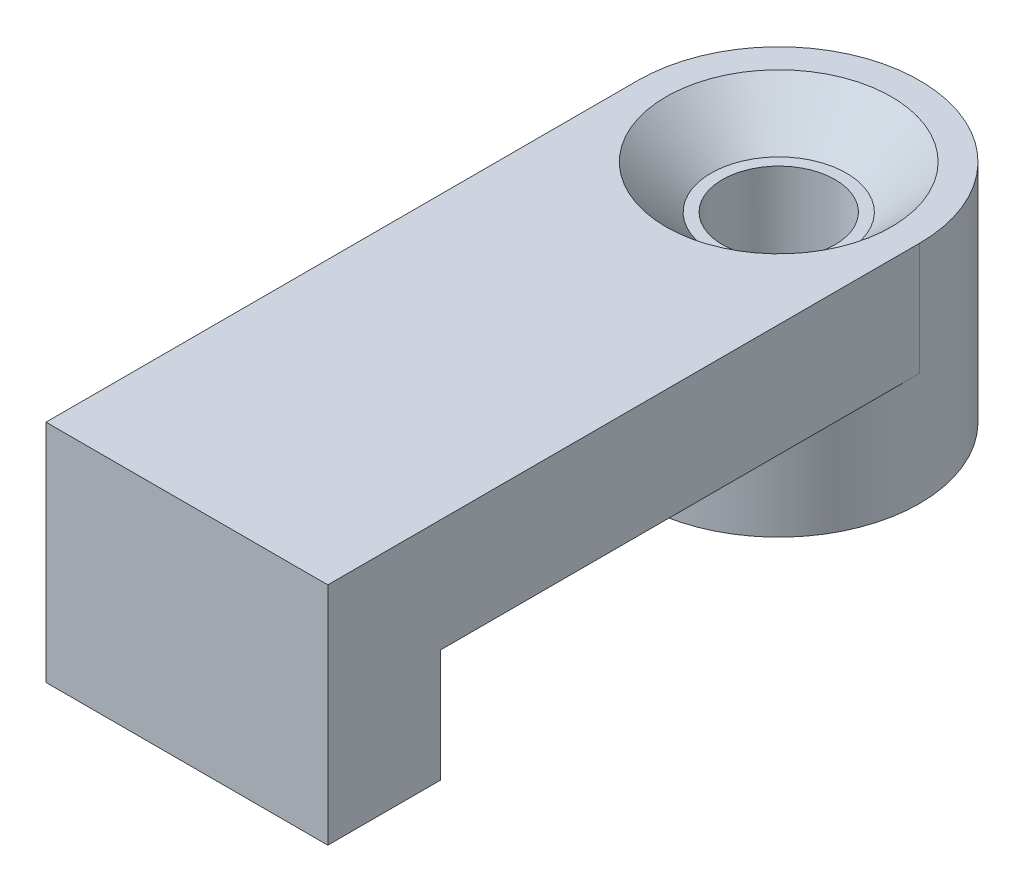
ISO-10303-21;
HEADER;
FILE_DESCRIPTION(('STEP AP214'),'2;1');
FILE_NAME('part.step','',(''),(''),'','','');
FILE_SCHEMA(('AUTOMOTIVE_DESIGN { 1 0 10303 214 1 1 1 1 }'));
ENDSEC;
DATA;
#1=APPLICATION_CONTEXT('core data for automotive mechanical design processes');
#2=APPLICATION_PROTOCOL_DEFINITION('international standard','automotive_design',2000,#1);
#3=PRODUCT_CONTEXT('',#1,'mechanical');
#4=PRODUCT('Part','Part','',(#3));
#5=PRODUCT_RELATED_PRODUCT_CATEGORY('part','',(#4));
#6=PRODUCT_DEFINITION_FORMATION('','',#4);
#7=PRODUCT_DEFINITION_CONTEXT('part definition',#1,'design');
#8=PRODUCT_DEFINITION('design','',#6,#7);
#9=PRODUCT_DEFINITION_SHAPE('','',#8);
#10=(LENGTH_UNIT() NAMED_UNIT(*) SI_UNIT(.MILLI.,.METRE.));
#11=(NAMED_UNIT(*) PLANE_ANGLE_UNIT() SI_UNIT($,.RADIAN.));
#12=(NAMED_UNIT(*) SI_UNIT($,.STERADIAN.) SOLID_ANGLE_UNIT());
#13=UNCERTAINTY_MEASURE_WITH_UNIT(LENGTH_MEASURE(1.E-05),#10,'distance_accuracy_value','');
#14=(GEOMETRIC_REPRESENTATION_CONTEXT(3) GLOBAL_UNCERTAINTY_ASSIGNED_CONTEXT((#13)) GLOBAL_UNIT_ASSIGNED_CONTEXT((#10,
#11,#12)) REPRESENTATION_CONTEXT('',''));
#15=CARTESIAN_POINT('',(0.,0.,0.));
#16=DIRECTION('',(0.,0.,1.));
#17=DIRECTION('',(1.,0.,0.));
#18=AXIS2_PLACEMENT_3D('',#15,#16,#17);
#19=CARTESIAN_POINT('',(0.,4.,0.));
#20=DIRECTION('',(0.,1.,0.));
#21=DIRECTION('',(0.,0.,1.));
#22=AXIS2_PLACEMENT_3D('',#19,#20,#21);
#23=PLANE('',#22);
#24=CARTESIAN_POINT('',(0.,4.,0.));
#25=DIRECTION('',(0.,1.,0.));
#26=DIRECTION('',(0.,0.,1.));
#27=AXIS2_PLACEMENT_3D('',#24,#25,#26);
#28=CIRCLE('',#27,2.);
#29=CARTESIAN_POINT('',(0.,4.,2.));
#30=VERTEX_POINT('',#29);
#31=EDGE_CURVE('E150',#30,#30,#28,.T.);
#32=ORIENTED_EDGE('',*,*,#31,.F.);
#33=EDGE_LOOP('',(#32));
#34=FACE_BOUND('',#33,.T.);
#35=CARTESIAN_POINT('',(0.,4.,0.));
#36=DIRECTION('',(0.,1.,0.));
#37=DIRECTION('',(0.,0.,1.));
#38=AXIS2_PLACEMENT_3D('',#35,#36,#37);
#39=CIRCLE('',#38,2.5);
#40=CARTESIAN_POINT('',(2.5,4.,0.));
#41=VERTEX_POINT('',#40);
#42=CARTESIAN_POINT('',(-2.5,4.,0.));
#43=VERTEX_POINT('',#42);
#44=EDGE_CURVE('E11',#41,#43,#39,.T.);
#45=ORIENTED_EDGE('',*,*,#44,.T.);
#46=DIRECTION('',(0.,0.,1.));
#47=VECTOR('',#46,1.);
#48=CARTESIAN_POINT('',(-2.5,4.,0.));
#49=LINE('',#48,#47);
#50=CARTESIAN_POINT('',(-2.5,4.,10.5));
#51=VERTEX_POINT('',#50);
#52=EDGE_CURVE('E77',#43,#51,#49,.T.);
#53=ORIENTED_EDGE('',*,*,#52,.T.);
#54=DIRECTION('',(1.,0.,0.));
#55=VECTOR('',#54,1.);
#56=CARTESIAN_POINT('',(-2.5,4.,10.5));
#57=LINE('',#56,#55);
#58=CARTESIAN_POINT('',(2.5,4.,10.5));
#59=VERTEX_POINT('',#58);
#60=EDGE_CURVE('E106',#51,#59,#57,.T.);
#61=ORIENTED_EDGE('',*,*,#60,.T.);
#62=DIRECTION('',(0.,0.,-1.));
#63=VECTOR('',#62,1.);
#64=CARTESIAN_POINT('',(2.5,4.,8.5));
#65=LINE('',#64,#63);
#66=EDGE_CURVE('E55',#59,#41,#65,.T.);
#67=ORIENTED_EDGE('',*,*,#66,.T.);
#68=EDGE_LOOP('',(#45,#53,#61,#67));
#69=FACE_BOUND('',#68,.T.);
#70=ADVANCED_FACE('F39',(#34,#69),#23,.T.);
#71=CARTESIAN_POINT('',(0.,0.,0.));
#72=DIRECTION('',(0.,1.,0.));
#73=DIRECTION('',(0.,0.,1.));
#74=AXIS2_PLACEMENT_3D('',#71,#72,#73);
#75=PLANE('',#74);
#76=CARTESIAN_POINT('',(0.,0.,0.));
#77=DIRECTION('',(0.,1.,0.));
#78=DIRECTION('',(0.,0.,1.));
#79=AXIS2_PLACEMENT_3D('',#76,#77,#78);
#80=CIRCLE('',#79,2.5);
#81=CARTESIAN_POINT('',(0.,0.,2.5));
#82=VERTEX_POINT('',#81);
#83=EDGE_CURVE('E48',#82,#82,#80,.T.);
#84=ORIENTED_EDGE('',*,*,#83,.F.);
#85=EDGE_LOOP('',(#84));
#86=FACE_BOUND('',#85,.T.);
#87=CARTESIAN_POINT('',(0.,0.,0.));
#88=DIRECTION('',(0.,1.,0.));
#89=DIRECTION('',(0.,0.,1.));
#90=AXIS2_PLACEMENT_3D('',#87,#88,#89);
#91=CIRCLE('',#90,1.);
#92=CARTESIAN_POINT('',(0.,0.,1.));
#93=VERTEX_POINT('',#92);
#94=EDGE_CURVE('E153',#93,#93,#91,.T.);
#95=ORIENTED_EDGE('',*,*,#94,.T.);
#96=EDGE_LOOP('',(#95));
#97=FACE_BOUND('',#96,.T.);
#98=ADVANCED_FACE('F159',(#86,#97),#75,.F.);
#99=CARTESIAN_POINT('',(0.,4.,0.));
#100=DIRECTION('',(0.,-1.,0.));
#101=DIRECTION('',(0.,0.,-1.));
#102=AXIS2_PLACEMENT_3D('',#99,#100,#101);
#103=CYLINDRICAL_SURFACE('',#102,2.5);
#104=ORIENTED_EDGE('',*,*,#44,.F.);
#105=DIRECTION('',(0.,1.,0.));
#106=VECTOR('',#105,1.);
#107=CARTESIAN_POINT('',(2.5,2.,0.));
#108=LINE('',#107,#106);
#109=CARTESIAN_POINT('',(2.5,2.,0.));
#110=VERTEX_POINT('',#109);
#111=EDGE_CURVE('E144',#110,#41,#108,.T.);
#112=ORIENTED_EDGE('',*,*,#111,.F.);
#113=CARTESIAN_POINT('',(0.,2.,0.));
#114=DIRECTION('',(0.,-1.,0.));
#115=DIRECTION('',(0.,0.,1.));
#116=AXIS2_PLACEMENT_3D('',#113,#114,#115);
#117=CIRCLE('',#116,2.5);
#118=CARTESIAN_POINT('',(-2.5,2.,0.));
#119=VERTEX_POINT('',#118);
#120=EDGE_CURVE('E64',#110,#119,#117,.T.);
#121=ORIENTED_EDGE('',*,*,#120,.T.);
#122=DIRECTION('',(0.,1.,0.));
#123=VECTOR('',#122,1.);
#124=CARTESIAN_POINT('',(-2.5,2.,0.));
#125=LINE('',#124,#123);
#126=EDGE_CURVE('E141',#119,#43,#125,.T.);
#127=ORIENTED_EDGE('',*,*,#126,.T.);
#128=EDGE_LOOP('',(#104,#112,#121,#127));
#129=FACE_BOUND('',#128,.T.);
#130=ORIENTED_EDGE('',*,*,#83,.T.);
#131=EDGE_LOOP('',(#130));
#132=FACE_BOUND('',#131,.T.);
#133=ADVANCED_FACE('F41',(#129,#132),#103,.T.);
#134=CARTESIAN_POINT('',(0.,4.,0.));
#135=DIRECTION('',(0.,-1.,0.));
#136=DIRECTION('',(0.,0.,-1.));
#137=AXIS2_PLACEMENT_3D('',#134,#135,#136);
#138=CYLINDRICAL_SURFACE('',#137,1.);
#139=CARTESIAN_POINT('',(0.,3.22744898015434,0.));
#140=DIRECTION('',(0.,-1.,0.));
#141=DIRECTION('',(0.,0.,-1.));
#142=AXIS2_PLACEMENT_3D('',#139,#140,#141);
#143=CIRCLE('',#142,1.);
#144=CARTESIAN_POINT('',(0.,3.22744898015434,-1.));
#145=VERTEX_POINT('',#144);
#146=EDGE_CURVE('E43',#145,#145,#143,.T.);
#147=ORIENTED_EDGE('',*,*,#146,.F.);
#148=EDGE_LOOP('',(#147));
#149=FACE_BOUND('',#148,.T.);
#150=ORIENTED_EDGE('',*,*,#94,.F.);
#151=EDGE_LOOP('',(#150));
#152=FACE_BOUND('',#151,.T.);
#153=ADVANCED_FACE('F164',(#149,#152),#138,.F.);
#154=CARTESIAN_POINT('',(0.,4.,0.));
#155=DIRECTION('',(0.,1.,0.));
#156=DIRECTION('',(0.,0.,1.));
#157=AXIS2_PLACEMENT_3D('',#154,#155,#156);
#158=CONICAL_SURFACE('',#157,2.,0.802851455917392);
#159=CARTESIAN_POINT('',(0.,3.22744898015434,0.));
#160=DIRECTION('',(0.,1.,0.));
#161=DIRECTION('',(0.,0.,1.));
#162=AXIS2_PLACEMENT_3D('',#159,#160,#161);
#163=CIRCLE('',#162,1.2);
#164=CARTESIAN_POINT('',(0.,3.22744898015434,1.2));
#165=VERTEX_POINT('',#164);
#166=EDGE_CURVE('E146',#165,#165,#163,.T.);
#167=ORIENTED_EDGE('',*,*,#166,.F.);
#168=EDGE_LOOP('',(#167));
#169=FACE_BOUND('',#168,.T.);
#170=ORIENTED_EDGE('',*,*,#31,.T.);
#171=EDGE_LOOP('',(#170));
#172=FACE_BOUND('',#171,.T.);
#173=ADVANCED_FACE('F166',(#169,#172),#158,.F.);
#174=CARTESIAN_POINT('',(1.2,3.22744898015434,0.));
#175=DIRECTION('',(0.,-1.,0.));
#176=DIRECTION('',(0.,0.,-1.));
#177=AXIS2_PLACEMENT_3D('',#174,#175,#176);
#178=PLANE('',#177);
#179=ORIENTED_EDGE('',*,*,#146,.T.);
#180=EDGE_LOOP('',(#179));
#181=FACE_BOUND('',#180,.T.);
#182=ORIENTED_EDGE('',*,*,#166,.T.);
#183=EDGE_LOOP('',(#182));
#184=FACE_BOUND('',#183,.T.);
#185=ADVANCED_FACE('F172',(#181,#184),#178,.F.);
#186=CARTESIAN_POINT('',(2.5,2.,8.5));
#187=DIRECTION('',(1.,0.,0.));
#188=DIRECTION('',(0.,0.,-1.));
#189=AXIS2_PLACEMENT_3D('',#186,#187,#188);
#190=PLANE('',#189);
#191=ORIENTED_EDGE('',*,*,#66,.F.);
#192=DIRECTION('',(0.,1.,0.));
#193=VECTOR('',#192,1.);
#194=CARTESIAN_POINT('',(2.5,0.,10.5));
#195=LINE('',#194,#193);
#196=CARTESIAN_POINT('',(2.5,0.,10.5));
#197=VERTEX_POINT('',#196);
#198=EDGE_CURVE('E108',#197,#59,#195,.T.);
#199=ORIENTED_EDGE('',*,*,#198,.F.);
#200=DIRECTION('',(0.,0.,-1.));
#201=VECTOR('',#200,1.);
#202=CARTESIAN_POINT('',(2.5,0.,8.5));
#203=LINE('',#202,#201);
#204=CARTESIAN_POINT('',(2.5,0.,8.5));
#205=VERTEX_POINT('',#204);
#206=EDGE_CURVE('E119',#197,#205,#203,.T.);
#207=ORIENTED_EDGE('',*,*,#206,.T.);
#208=DIRECTION('',(0.,1.,0.));
#209=VECTOR('',#208,1.);
#210=CARTESIAN_POINT('',(2.5,0.,8.5));
#211=LINE('',#210,#209);
#212=CARTESIAN_POINT('',(2.5,2.,8.5));
#213=VERTEX_POINT('',#212);
#214=EDGE_CURVE('E131',#205,#213,#211,.T.);
#215=ORIENTED_EDGE('',*,*,#214,.T.);
#216=DIRECTION('',(0.,0.,-1.));
#217=VECTOR('',#216,1.);
#218=CARTESIAN_POINT('',(2.5,2.,8.5));
#219=LINE('',#218,#217);
#220=EDGE_CURVE('E81',#213,#110,#219,.T.);
#221=ORIENTED_EDGE('',*,*,#220,.T.);
#222=ORIENTED_EDGE('',*,*,#111,.T.);
#223=EDGE_LOOP('',(#191,#199,#207,#215,#221,#222));
#224=FACE_BOUND('',#223,.T.);
#225=ADVANCED_FACE('F191',(#224),#190,.T.);
#226=CARTESIAN_POINT('',(-2.5,2.,0.));
#227=DIRECTION('',(-1.,0.,0.));
#228=DIRECTION('',(0.,0.,1.));
#229=AXIS2_PLACEMENT_3D('',#226,#227,#228);
#230=PLANE('',#229);
#231=ORIENTED_EDGE('',*,*,#52,.F.);
#232=ORIENTED_EDGE('',*,*,#126,.F.);
#233=DIRECTION('',(0.,0.,1.));
#234=VECTOR('',#233,1.);
#235=CARTESIAN_POINT('',(-2.5,2.,0.));
#236=LINE('',#235,#234);
#237=CARTESIAN_POINT('',(-2.5,2.,8.5));
#238=VERTEX_POINT('',#237);
#239=EDGE_CURVE('E136',#119,#238,#236,.T.);
#240=ORIENTED_EDGE('',*,*,#239,.T.);
#241=DIRECTION('',(0.,1.,0.));
#242=VECTOR('',#241,1.);
#243=CARTESIAN_POINT('',(-2.5,0.,8.5));
#244=LINE('',#243,#242);
#245=CARTESIAN_POINT('',(-2.5,0.,8.5));
#246=VERTEX_POINT('',#245);
#247=EDGE_CURVE('E124',#246,#238,#244,.T.);
#248=ORIENTED_EDGE('',*,*,#247,.F.);
#249=DIRECTION('',(0.,0.,1.));
#250=VECTOR('',#249,1.);
#251=CARTESIAN_POINT('',(-2.5,0.,8.5));
#252=LINE('',#251,#250);
#253=CARTESIAN_POINT('',(-2.5,0.,10.5));
#254=VERTEX_POINT('',#253);
#255=EDGE_CURVE('E116',#246,#254,#252,.T.);
#256=ORIENTED_EDGE('',*,*,#255,.T.);
#257=DIRECTION('',(0.,1.,0.));
#258=VECTOR('',#257,1.);
#259=CARTESIAN_POINT('',(-2.5,0.,10.5));
#260=LINE('',#259,#258);
#261=EDGE_CURVE('E101',#254,#51,#260,.T.);
#262=ORIENTED_EDGE('',*,*,#261,.T.);
#263=EDGE_LOOP('',(#231,#232,#240,#248,#256,#262));
#264=FACE_BOUND('',#263,.T.);
#265=ADVANCED_FACE('F121',(#264),#230,.T.);
#266=CARTESIAN_POINT('',(0.,2.,0.));
#267=DIRECTION('',(0.,1.,0.));
#268=DIRECTION('',(0.,0.,1.));
#269=AXIS2_PLACEMENT_3D('',#266,#267,#268);
#270=PLANE('',#269);
#271=ORIENTED_EDGE('',*,*,#120,.F.);
#272=ORIENTED_EDGE('',*,*,#220,.F.);
#273=DIRECTION('',(1.,0.,0.));
#274=VECTOR('',#273,1.);
#275=CARTESIAN_POINT('',(-2.5,2.,8.5));
#276=LINE('',#275,#274);
#277=EDGE_CURVE('E138',#238,#213,#276,.T.);
#278=ORIENTED_EDGE('',*,*,#277,.F.);
#279=ORIENTED_EDGE('',*,*,#239,.F.);
#280=EDGE_LOOP('',(#271,#272,#278,#279));
#281=FACE_BOUND('',#280,.T.);
#282=ADVANCED_FACE('F187',(#281),#270,.F.);
#283=CARTESIAN_POINT('',(-2.5,0.,8.5));
#284=DIRECTION('',(0.,0.,-1.));
#285=DIRECTION('',(-1.,0.,0.));
#286=AXIS2_PLACEMENT_3D('',#283,#284,#285);
#287=PLANE('',#286);
#288=ORIENTED_EDGE('',*,*,#247,.T.);
#289=ORIENTED_EDGE('',*,*,#277,.T.);
#290=ORIENTED_EDGE('',*,*,#214,.F.);
#291=DIRECTION('',(-1.,0.,0.));
#292=VECTOR('',#291,1.);
#293=CARTESIAN_POINT('',(-2.5,0.,8.5));
#294=LINE('',#293,#292);
#295=EDGE_CURVE('E109',#205,#246,#294,.T.);
#296=ORIENTED_EDGE('',*,*,#295,.T.);
#297=EDGE_LOOP('',(#288,#289,#290,#296));
#298=FACE_BOUND('',#297,.T.);
#299=ADVANCED_FACE('F189',(#298),#287,.T.);
#300=CARTESIAN_POINT('',(-2.5,0.,10.5));
#301=DIRECTION('',(0.,0.,1.));
#302=DIRECTION('',(1.,0.,0.));
#303=AXIS2_PLACEMENT_3D('',#300,#301,#302);
#304=PLANE('',#303);
#305=ORIENTED_EDGE('',*,*,#60,.F.);
#306=ORIENTED_EDGE('',*,*,#261,.F.);
#307=DIRECTION('',(1.,0.,0.));
#308=VECTOR('',#307,1.);
#309=CARTESIAN_POINT('',(-2.5,0.,10.5));
#310=LINE('',#309,#308);
#311=EDGE_CURVE('E105',#254,#197,#310,.T.);
#312=ORIENTED_EDGE('',*,*,#311,.T.);
#313=ORIENTED_EDGE('',*,*,#198,.T.);
#314=EDGE_LOOP('',(#305,#306,#312,#313));
#315=FACE_BOUND('',#314,.T.);
#316=ADVANCED_FACE('F103',(#315),#304,.T.);
#317=CARTESIAN_POINT('',(0.,0.,0.));
#318=DIRECTION('',(0.,1.,0.));
#319=DIRECTION('',(0.,0.,1.));
#320=AXIS2_PLACEMENT_3D('',#317,#318,#319);
#321=PLANE('',#320);
#322=ORIENTED_EDGE('',*,*,#255,.F.);
#323=ORIENTED_EDGE('',*,*,#295,.F.);
#324=ORIENTED_EDGE('',*,*,#206,.F.);
#325=ORIENTED_EDGE('',*,*,#311,.F.);
#326=EDGE_LOOP('',(#322,#323,#324,#325));
#327=FACE_BOUND('',#326,.T.);
#328=ADVANCED_FACE('F114',(#327),#321,.F.);
#329=CLOSED_SHELL('',(#70,#98,#133,#153,#173,#185,#225,#265,#282,#299,#316,#328));
#330=MANIFOLD_SOLID_BREP('B2',#329);
#331=ADVANCED_BREP_SHAPE_REPRESENTATION('',(#18,#330),#14);
#332=SHAPE_DEFINITION_REPRESENTATION(#9,#331);
ENDSEC;
END-ISO-10303-21;
